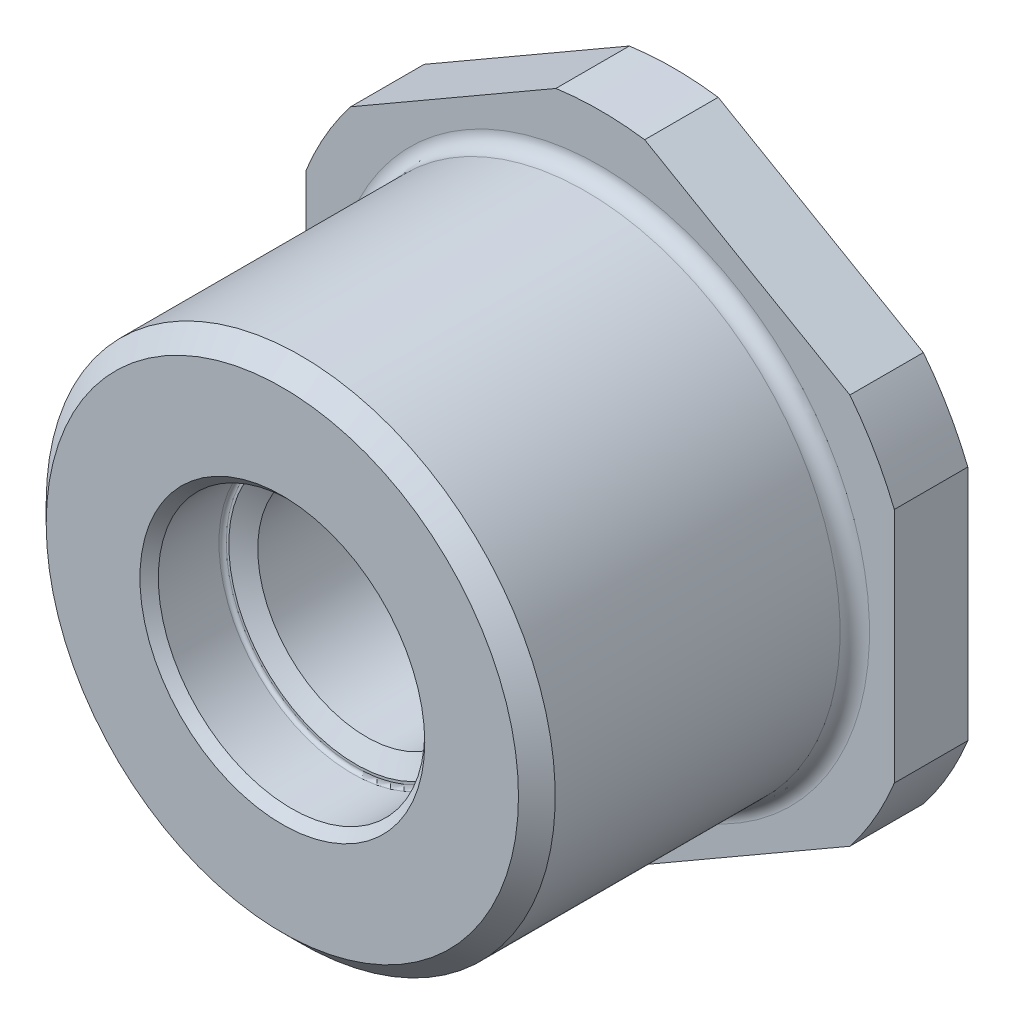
ISO-10303-21;
HEADER;
FILE_DESCRIPTION(('STEP AP214'),'2;1');
FILE_NAME('part.step','',(''),(''),'','','');
FILE_SCHEMA(('AUTOMOTIVE_DESIGN { 1 0 10303 214 1 1 1 1 }'));
ENDSEC;
DATA;
#1=APPLICATION_CONTEXT('core data for automotive mechanical design processes');
#2=APPLICATION_PROTOCOL_DEFINITION('international standard','automotive_design',2000,#1);
#3=PRODUCT_CONTEXT('',#1,'mechanical');
#4=PRODUCT('Part','Part','',(#3));
#5=PRODUCT_RELATED_PRODUCT_CATEGORY('part','',(#4));
#6=PRODUCT_DEFINITION_FORMATION('','',#4);
#7=PRODUCT_DEFINITION_CONTEXT('part definition',#1,'design');
#8=PRODUCT_DEFINITION('design','',#6,#7);
#9=PRODUCT_DEFINITION_SHAPE('','',#8);
#10=(LENGTH_UNIT() NAMED_UNIT(*) SI_UNIT(.MILLI.,.METRE.));
#11=(NAMED_UNIT(*) PLANE_ANGLE_UNIT() SI_UNIT($,.RADIAN.));
#12=(NAMED_UNIT(*) SI_UNIT($,.STERADIAN.) SOLID_ANGLE_UNIT());
#13=UNCERTAINTY_MEASURE_WITH_UNIT(LENGTH_MEASURE(1.E-05),#10,'distance_accuracy_value','');
#14=(GEOMETRIC_REPRESENTATION_CONTEXT(3) GLOBAL_UNCERTAINTY_ASSIGNED_CONTEXT((#13)) GLOBAL_UNIT_ASSIGNED_CONTEXT((#10,
#11,#12)) REPRESENTATION_CONTEXT('',''));
#15=CARTESIAN_POINT('',(0.,0.,0.));
#16=DIRECTION('',(0.,0.,1.));
#17=DIRECTION('',(1.,0.,0.));
#18=AXIS2_PLACEMENT_3D('',#15,#16,#17);
#19=CARTESIAN_POINT('',(-16.,-9.23760430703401,4.));
#20=DIRECTION('',(0.,0.,-0.999999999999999));
#21=DIRECTION('',(-1.,0.,0.));
#22=AXIS2_PLACEMENT_3D('',#19,#20,#21);
#23=PLANE('',#22);
#24=CARTESIAN_POINT('',(0.,0.,4.));
#25=DIRECTION('',(0.,0.,-0.999999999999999));
#26=DIRECTION('',(-1.,0.,0.));
#27=AXIS2_PLACEMENT_3D('',#24,#25,#26);
#28=CIRCLE('',#27,14.65);
#29=CARTESIAN_POINT('',(-14.65,0.,4.));
#30=VERTEX_POINT('',#29);
#31=EDGE_CURVE('E172',#30,#30,#28,.T.);
#32=ORIENTED_EDGE('',*,*,#31,.T.);
#33=EDGE_LOOP('',(#32));
#34=FACE_BOUND('',#33,.T.);
#35=CARTESIAN_POINT('',(0.,0.,4.));
#36=DIRECTION('',(0.,0.,-0.999999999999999));
#37=DIRECTION('',(-1.,0.,0.));
#38=AXIS2_PLACEMENT_3D('',#35,#36,#37);
#39=CIRCLE('',#38,17.25);
#40=CARTESIAN_POINT('',(-16.,6.44689847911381,4.));
#41=VERTEX_POINT('',#40);
#42=CARTESIAN_POINT('',(-13.5831778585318,10.6329572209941,4.));
#43=VERTEX_POINT('',#42);
#44=EDGE_CURVE('E138',#41,#43,#39,.T.);
#45=ORIENTED_EDGE('',*,*,#44,.F.);
#46=DIRECTION('',(0.,-1.,0.));
#47=VECTOR('',#46,1.);
#48=CARTESIAN_POINT('',(-16.,9.237604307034,4.));
#49=LINE('',#48,#47);
#50=CARTESIAN_POINT('',(-16.,-6.44689847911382,4.));
#51=VERTEX_POINT('',#50);
#52=EDGE_CURVE('E137',#41,#51,#49,.T.);
#53=ORIENTED_EDGE('',*,*,#52,.T.);
#54=CARTESIAN_POINT('',(-13.5831778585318,-10.6329572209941,4.));
#55=VERTEX_POINT('',#54);
#56=EDGE_CURVE('E263',#55,#51,#39,.T.);
#57=ORIENTED_EDGE('',*,*,#56,.F.);
#58=DIRECTION('',(0.866025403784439,-0.499999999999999,0.));
#59=VECTOR('',#58,1.);
#60=CARTESIAN_POINT('',(-16.,-9.23760430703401,4.));
#61=LINE('',#60,#59);
#62=CARTESIAN_POINT('',(-2.41682214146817,-17.0798557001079,4.));
#63=VERTEX_POINT('',#62);
#64=EDGE_CURVE('E144',#55,#63,#61,.T.);
#65=ORIENTED_EDGE('',*,*,#64,.T.);
#66=CARTESIAN_POINT('',(2.4168221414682,-17.0798557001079,4.));
#67=VERTEX_POINT('',#66);
#68=EDGE_CURVE('E250',#67,#63,#39,.T.);
#69=ORIENTED_EDGE('',*,*,#68,.F.);
#70=DIRECTION('',(0.866025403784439,0.500000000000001,0.));
#71=VECTOR('',#70,1.);
#72=CARTESIAN_POINT('',(0.,-18.475208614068,4.));
#73=LINE('',#72,#71);
#74=CARTESIAN_POINT('',(13.5831778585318,-10.6329572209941,4.));
#75=VERTEX_POINT('',#74);
#76=EDGE_CURVE('E148',#67,#75,#73,.T.);
#77=ORIENTED_EDGE('',*,*,#76,.T.);
#78=CARTESIAN_POINT('',(16.,-6.44689847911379,4.));
#79=VERTEX_POINT('',#78);
#80=EDGE_CURVE('E245',#79,#75,#39,.T.);
#81=ORIENTED_EDGE('',*,*,#80,.F.);
#82=DIRECTION('',(0.,1.,0.));
#83=VECTOR('',#82,1.);
#84=CARTESIAN_POINT('',(16.,-9.23760430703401,4.));
#85=LINE('',#84,#83);
#86=CARTESIAN_POINT('',(16.,6.44689847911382,4.));
#87=VERTEX_POINT('',#86);
#88=EDGE_CURVE('E156',#79,#87,#85,.T.);
#89=ORIENTED_EDGE('',*,*,#88,.T.);
#90=CARTESIAN_POINT('',(13.5831778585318,10.6329572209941,4.));
#91=VERTEX_POINT('',#90);
#92=EDGE_CURVE('E262',#91,#87,#39,.T.);
#93=ORIENTED_EDGE('',*,*,#92,.F.);
#94=DIRECTION('',(-0.866025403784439,0.5,0.));
#95=VECTOR('',#94,1.);
#96=CARTESIAN_POINT('',(16.,9.23760430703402,4.));
#97=LINE('',#96,#95);
#98=CARTESIAN_POINT('',(2.41682214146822,17.0798557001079,4.));
#99=VERTEX_POINT('',#98);
#100=EDGE_CURVE('E159',#91,#99,#97,.T.);
#101=ORIENTED_EDGE('',*,*,#100,.T.);
#102=CARTESIAN_POINT('',(-2.41682214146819,17.0798557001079,4.));
#103=VERTEX_POINT('',#102);
#104=EDGE_CURVE('E266',#103,#99,#39,.T.);
#105=ORIENTED_EDGE('',*,*,#104,.F.);
#106=DIRECTION('',(-0.866025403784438,-0.500000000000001,0.));
#107=VECTOR('',#106,1.);
#108=CARTESIAN_POINT('',(0.,18.475208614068,4.));
#109=LINE('',#108,#107);
#110=EDGE_CURVE('E162',#103,#43,#109,.T.);
#111=ORIENTED_EDGE('',*,*,#110,.T.);
#112=EDGE_LOOP('',(#45,#53,#57,#65,#69,#77,#81,#89,#93,#101,#105,#111));
#113=FACE_BOUND('',#112,.T.);
#114=ADVANCED_FACE('F30',(#34,#113),#23,.F.);
#115=CARTESIAN_POINT('',(-16.,-9.23760430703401,4.));
#116=DIRECTION('',(0.5,0.866025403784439,0.));
#117=DIRECTION('',(-0.866025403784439,0.499999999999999,0.));
#118=AXIS2_PLACEMENT_3D('',#115,#116,#117);
#119=PLANE('',#118);
#120=DIRECTION('',(0.,0.,-0.999999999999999));
#121=VECTOR('',#120,1.);
#122=CARTESIAN_POINT('',(-2.41682214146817,-17.0798557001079,21.3));
#123=LINE('',#122,#121);
#124=CARTESIAN_POINT('',(-2.41682214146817,-17.0798557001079,0.));
#125=VERTEX_POINT('',#124);
#126=EDGE_CURVE('E255',#63,#125,#123,.T.);
#127=ORIENTED_EDGE('',*,*,#126,.F.);
#128=ORIENTED_EDGE('',*,*,#64,.F.);
#129=DIRECTION('',(0.,0.,-0.999999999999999));
#130=VECTOR('',#129,1.);
#131=CARTESIAN_POINT('',(-13.5831778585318,-10.6329572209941,21.3));
#132=LINE('',#131,#130);
#133=CARTESIAN_POINT('',(-13.5831778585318,-10.6329572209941,0.));
#134=VERTEX_POINT('',#133);
#135=EDGE_CURVE('E265',#134,#55,#132,.F.);
#136=ORIENTED_EDGE('',*,*,#135,.F.);
#137=DIRECTION('',(0.866025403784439,-0.499999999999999,0.));
#138=VECTOR('',#137,1.);
#139=CARTESIAN_POINT('',(-16.,-9.23760430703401,0.));
#140=LINE('',#139,#138);
#141=EDGE_CURVE('E286',#134,#125,#140,.T.);
#142=ORIENTED_EDGE('',*,*,#141,.T.);
#143=EDGE_LOOP('',(#127,#128,#136,#142));
#144=FACE_BOUND('',#143,.T.);
#145=ADVANCED_FACE('F32',(#144),#119,.F.);
#146=CARTESIAN_POINT('',(0.,-18.475208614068,4.));
#147=DIRECTION('',(-0.5,0.866025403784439,0.));
#148=DIRECTION('',(-0.866025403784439,-0.500000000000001,0.));
#149=AXIS2_PLACEMENT_3D('',#146,#147,#148);
#150=PLANE('',#149);
#151=DIRECTION('',(0.,0.,-0.999999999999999));
#152=VECTOR('',#151,1.);
#153=CARTESIAN_POINT('',(13.5831778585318,-10.6329572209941,21.3));
#154=LINE('',#153,#152);
#155=CARTESIAN_POINT('',(13.5831778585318,-10.6329572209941,0.));
#156=VERTEX_POINT('',#155);
#157=EDGE_CURVE('E45',#75,#156,#154,.T.);
#158=ORIENTED_EDGE('',*,*,#157,.F.);
#159=ORIENTED_EDGE('',*,*,#76,.F.);
#160=DIRECTION('',(0.,0.,-0.999999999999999));
#161=VECTOR('',#160,1.);
#162=CARTESIAN_POINT('',(2.4168221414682,-17.0798557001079,21.3));
#163=LINE('',#162,#161);
#164=CARTESIAN_POINT('',(2.41682214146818,-17.0798557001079,0.));
#165=VERTEX_POINT('',#164);
#166=EDGE_CURVE('E244',#165,#67,#163,.F.);
#167=ORIENTED_EDGE('',*,*,#166,.F.);
#168=DIRECTION('',(0.866025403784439,0.500000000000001,0.));
#169=VECTOR('',#168,1.);
#170=CARTESIAN_POINT('',(0.,-18.475208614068,0.));
#171=LINE('',#170,#169);
#172=EDGE_CURVE('E243',#165,#156,#171,.T.);
#173=ORIENTED_EDGE('',*,*,#172,.T.);
#174=EDGE_LOOP('',(#158,#159,#167,#173));
#175=FACE_BOUND('',#174,.T.);
#176=ADVANCED_FACE('F216',(#175),#150,.F.);
#177=CARTESIAN_POINT('',(16.,-9.23760430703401,4.));
#178=DIRECTION('',(-1.,0.,0.));
#179=DIRECTION('',(0.,-1.,0.));
#180=AXIS2_PLACEMENT_3D('',#177,#178,#179);
#181=PLANE('',#180);
#182=DIRECTION('',(0.,0.,-0.999999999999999));
#183=VECTOR('',#182,1.);
#184=CARTESIAN_POINT('',(16.,6.44689847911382,21.3));
#185=LINE('',#184,#183);
#186=CARTESIAN_POINT('',(16.,6.44689847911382,0.));
#187=VERTEX_POINT('',#186);
#188=EDGE_CURVE('E53',#87,#187,#185,.T.);
#189=ORIENTED_EDGE('',*,*,#188,.F.);
#190=ORIENTED_EDGE('',*,*,#88,.F.);
#191=DIRECTION('',(0.,0.,-0.999999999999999));
#192=VECTOR('',#191,1.);
#193=CARTESIAN_POINT('',(16.,-6.44689847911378,21.3));
#194=LINE('',#193,#192);
#195=CARTESIAN_POINT('',(16.,-6.4468984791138,0.));
#196=VERTEX_POINT('',#195);
#197=EDGE_CURVE('E261',#196,#79,#194,.F.);
#198=ORIENTED_EDGE('',*,*,#197,.F.);
#199=DIRECTION('',(0.,1.,0.));
#200=VECTOR('',#199,1.);
#201=CARTESIAN_POINT('',(16.,-9.23760430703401,0.));
#202=LINE('',#201,#200);
#203=EDGE_CURVE('E290',#196,#187,#202,.T.);
#204=ORIENTED_EDGE('',*,*,#203,.T.);
#205=EDGE_LOOP('',(#189,#190,#198,#204));
#206=FACE_BOUND('',#205,.T.);
#207=ADVANCED_FACE('F231',(#206),#181,.F.);
#208=CARTESIAN_POINT('',(16.,9.23760430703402,4.));
#209=DIRECTION('',(-0.5,-0.866025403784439,0.));
#210=DIRECTION('',(0.866025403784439,-0.5,0.));
#211=AXIS2_PLACEMENT_3D('',#208,#209,#210);
#212=PLANE('',#211);
#213=DIRECTION('',(0.,0.,-0.999999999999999));
#214=VECTOR('',#213,1.);
#215=CARTESIAN_POINT('',(2.41682214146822,17.0798557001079,21.3));
#216=LINE('',#215,#214);
#217=CARTESIAN_POINT('',(2.41682214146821,17.0798557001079,0.));
#218=VERTEX_POINT('',#217);
#219=EDGE_CURVE('E271',#99,#218,#216,.T.);
#220=ORIENTED_EDGE('',*,*,#219,.F.);
#221=ORIENTED_EDGE('',*,*,#100,.F.);
#222=DIRECTION('',(0.,0.,-0.999999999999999));
#223=VECTOR('',#222,1.);
#224=CARTESIAN_POINT('',(13.5831778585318,10.6329572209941,21.3));
#225=LINE('',#224,#223);
#226=CARTESIAN_POINT('',(13.5831778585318,10.6329572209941,0.));
#227=VERTEX_POINT('',#226);
#228=EDGE_CURVE('E275',#227,#91,#225,.F.);
#229=ORIENTED_EDGE('',*,*,#228,.F.);
#230=DIRECTION('',(-0.866025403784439,0.5,0.));
#231=VECTOR('',#230,1.);
#232=CARTESIAN_POINT('',(16.,9.23760430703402,0.));
#233=LINE('',#232,#231);
#234=EDGE_CURVE('E150',#227,#218,#233,.T.);
#235=ORIENTED_EDGE('',*,*,#234,.T.);
#236=EDGE_LOOP('',(#220,#221,#229,#235));
#237=FACE_BOUND('',#236,.T.);
#238=ADVANCED_FACE('F227',(#237),#212,.F.);
#239=CARTESIAN_POINT('',(0.,18.475208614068,4.));
#240=DIRECTION('',(0.500000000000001,-0.866025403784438,0.));
#241=DIRECTION('',(0.866025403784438,0.500000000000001,0.));
#242=AXIS2_PLACEMENT_3D('',#239,#240,#241);
#243=PLANE('',#242);
#244=DIRECTION('',(0.,0.,-0.999999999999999));
#245=VECTOR('',#244,1.);
#246=CARTESIAN_POINT('',(-13.5831778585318,10.6329572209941,21.3));
#247=LINE('',#246,#245);
#248=CARTESIAN_POINT('',(-13.5831778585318,10.6329572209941,0.));
#249=VERTEX_POINT('',#248);
#250=EDGE_CURVE('E124',#43,#249,#247,.T.);
#251=ORIENTED_EDGE('',*,*,#250,.F.);
#252=ORIENTED_EDGE('',*,*,#110,.F.);
#253=DIRECTION('',(0.,0.,-0.999999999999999));
#254=VECTOR('',#253,1.);
#255=CARTESIAN_POINT('',(-2.41682214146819,17.0798557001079,21.3));
#256=LINE('',#255,#254);
#257=CARTESIAN_POINT('',(-2.4168221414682,17.0798557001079,0.));
#258=VERTEX_POINT('',#257);
#259=EDGE_CURVE('E268',#258,#103,#256,.F.);
#260=ORIENTED_EDGE('',*,*,#259,.F.);
#261=DIRECTION('',(-0.866025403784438,-0.500000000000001,0.));
#262=VECTOR('',#261,1.);
#263=CARTESIAN_POINT('',(0.,18.475208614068,0.));
#264=LINE('',#263,#262);
#265=EDGE_CURVE('E145',#258,#249,#264,.T.);
#266=ORIENTED_EDGE('',*,*,#265,.T.);
#267=EDGE_LOOP('',(#251,#252,#260,#266));
#268=FACE_BOUND('',#267,.T.);
#269=ADVANCED_FACE('F224',(#268),#243,.F.);
#270=CARTESIAN_POINT('',(-16.,9.237604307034,4.));
#271=DIRECTION('',(1.,0.,0.));
#272=DIRECTION('',(0.,0.,-0.999999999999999));
#273=AXIS2_PLACEMENT_3D('',#270,#271,#272);
#274=PLANE('',#273);
#275=DIRECTION('',(0.,0.,-0.999999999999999));
#276=VECTOR('',#275,1.);
#277=CARTESIAN_POINT('',(-16.,-6.44689847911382,21.3));
#278=LINE('',#277,#276);
#279=CARTESIAN_POINT('',(-16.,-6.44689847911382,0.));
#280=VERTEX_POINT('',#279);
#281=EDGE_CURVE('E264',#51,#280,#278,.T.);
#282=ORIENTED_EDGE('',*,*,#281,.F.);
#283=ORIENTED_EDGE('',*,*,#52,.F.);
#284=DIRECTION('',(0.,0.,-0.999999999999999));
#285=VECTOR('',#284,1.);
#286=CARTESIAN_POINT('',(-16.,6.44689847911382,21.3));
#287=LINE('',#286,#285);
#288=CARTESIAN_POINT('',(-16.,6.44689847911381,0.));
#289=VERTEX_POINT('',#288);
#290=EDGE_CURVE('E121',#289,#41,#287,.F.);
#291=ORIENTED_EDGE('',*,*,#290,.F.);
#292=DIRECTION('',(0.,-1.,0.));
#293=VECTOR('',#292,1.);
#294=CARTESIAN_POINT('',(-16.,9.23760430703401,0.));
#295=LINE('',#294,#293);
#296=EDGE_CURVE('E135',#289,#280,#295,.T.);
#297=ORIENTED_EDGE('',*,*,#296,.T.);
#298=EDGE_LOOP('',(#282,#283,#291,#297));
#299=FACE_BOUND('',#298,.T.);
#300=ADVANCED_FACE('F134',(#299),#274,.F.);
#301=CARTESIAN_POINT('',(-16.,-9.23760430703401,0.));
#302=DIRECTION('',(0.,0.,-0.999999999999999));
#303=DIRECTION('',(-1.,0.,0.));
#304=AXIS2_PLACEMENT_3D('',#301,#302,#303);
#305=PLANE('',#304);
#306=CARTESIAN_POINT('',(0.,0.,0.));
#307=DIRECTION('',(0.,0.,0.999999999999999));
#308=DIRECTION('',(1.,0.,0.));
#309=AXIS2_PLACEMENT_3D('',#306,#307,#308);
#310=CIRCLE('',#309,5.915);
#311=CARTESIAN_POINT('',(5.915,0.,0.));
#312=VERTEX_POINT('',#311);
#313=EDGE_CURVE('E257',#312,#312,#310,.T.);
#314=ORIENTED_EDGE('',*,*,#313,.T.);
#315=EDGE_LOOP('',(#314));
#316=FACE_BOUND('',#315,.T.);
#317=ORIENTED_EDGE('',*,*,#296,.F.);
#318=CARTESIAN_POINT('',(0.,0.,0.));
#319=DIRECTION('',(0.,0.,-0.999999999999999));
#320=DIRECTION('',(-1.,0.,0.));
#321=AXIS2_PLACEMENT_3D('',#318,#319,#320);
#322=CIRCLE('',#321,17.25);
#323=EDGE_CURVE('E118',#289,#249,#322,.T.);
#324=ORIENTED_EDGE('',*,*,#323,.T.);
#325=ORIENTED_EDGE('',*,*,#265,.F.);
#326=CARTESIAN_POINT('',(0.,0.,0.));
#327=DIRECTION('',(0.,0.,-0.999999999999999));
#328=DIRECTION('',(-1.,0.,0.));
#329=AXIS2_PLACEMENT_3D('',#326,#327,#328);
#330=CIRCLE('',#329,17.25);
#331=EDGE_CURVE('E168',#258,#218,#330,.T.);
#332=ORIENTED_EDGE('',*,*,#331,.T.);
#333=ORIENTED_EDGE('',*,*,#234,.F.);
#334=EDGE_CURVE('E297',#227,#187,#330,.T.);
#335=ORIENTED_EDGE('',*,*,#334,.T.);
#336=ORIENTED_EDGE('',*,*,#203,.F.);
#337=EDGE_CURVE('E299',#196,#156,#330,.T.);
#338=ORIENTED_EDGE('',*,*,#337,.T.);
#339=ORIENTED_EDGE('',*,*,#172,.F.);
#340=EDGE_CURVE('E167',#165,#125,#330,.T.);
#341=ORIENTED_EDGE('',*,*,#340,.T.);
#342=ORIENTED_EDGE('',*,*,#141,.F.);
#343=EDGE_CURVE('E143',#134,#280,#330,.T.);
#344=ORIENTED_EDGE('',*,*,#343,.T.);
#345=EDGE_LOOP('',(#317,#324,#325,#332,#333,#335,#336,#338,#339,#341,#342,#344));
#346=FACE_BOUND('',#345,.T.);
#347=ADVANCED_FACE('F141',(#316,#346),#305,.T.);
#348=CARTESIAN_POINT('',(0.,0.,21.3));
#349=DIRECTION('',(0.,0.,-0.999999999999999));
#350=DIRECTION('',(-1.,0.,0.));
#351=AXIS2_PLACEMENT_3D('',#348,#349,#350);
#352=CYLINDRICAL_SURFACE('',#351,13.85);
#353=CARTESIAN_POINT('',(0.,0.,20.3));
#354=DIRECTION('',(0.,0.,0.999999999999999));
#355=DIRECTION('',(1.,0.,0.));
#356=AXIS2_PLACEMENT_3D('',#353,#354,#355);
#357=CIRCLE('',#356,13.85);
#358=CARTESIAN_POINT('',(-13.85,0.,20.3));
#359=VERTEX_POINT('',#358);
#360=EDGE_CURVE('E178',#359,#359,#357,.F.);
#361=CARTESIAN_POINT('',(0.,0.,4.8));
#362=DIRECTION('',(0.,0.,-0.999999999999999));
#363=DIRECTION('',(-1.,0.,0.));
#364=AXIS2_PLACEMENT_3D('',#361,#362,#363);
#365=CIRCLE('',#364,13.85);
#366=CARTESIAN_POINT('',(-13.85,0.,4.8));
#367=VERTEX_POINT('',#366);
#368=EDGE_CURVE('E169',#367,#367,#365,.F.);
#369=CARTESIAN_POINT('',(-13.85,0.,20.3));
#370=CARTESIAN_POINT('',(-13.85,0.,20.1385416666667));
#371=CARTESIAN_POINT('',(-13.85,0.,19.9770833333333));
#372=CARTESIAN_POINT('',(-13.85,0.,19.6541666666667));
#373=CARTESIAN_POINT('',(-13.85,0.,19.4927083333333));
#374=CARTESIAN_POINT('',(-13.85,0.,19.1697916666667));
#375=CARTESIAN_POINT('',(-13.85,0.,19.0083333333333));
#376=CARTESIAN_POINT('',(-13.85,0.,18.6854166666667));
#377=CARTESIAN_POINT('',(-13.85,0.,18.5239583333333));
#378=CARTESIAN_POINT('',(-13.85,0.,18.2010416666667));
#379=CARTESIAN_POINT('',(-13.85,0.,18.0395833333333));
#380=CARTESIAN_POINT('',(-13.85,0.,17.7166666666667));
#381=CARTESIAN_POINT('',(-13.85,0.,17.5552083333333));
#382=CARTESIAN_POINT('',(-13.85,0.,17.2322916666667));
#383=CARTESIAN_POINT('',(-13.85,0.,17.0708333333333));
#384=CARTESIAN_POINT('',(-13.85,0.,16.7479166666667));
#385=CARTESIAN_POINT('',(-13.85,0.,16.5864583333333));
#386=CARTESIAN_POINT('',(-13.85,0.,16.2635416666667));
#387=CARTESIAN_POINT('',(-13.85,0.,16.1020833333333));
#388=CARTESIAN_POINT('',(-13.85,0.,15.7791666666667));
#389=CARTESIAN_POINT('',(-13.85,0.,15.6177083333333));
#390=CARTESIAN_POINT('',(-13.85,0.,15.2947916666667));
#391=CARTESIAN_POINT('',(-13.85,0.,15.1333333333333));
#392=CARTESIAN_POINT('',(-13.85,0.,14.8104166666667));
#393=CARTESIAN_POINT('',(-13.85,0.,14.6489583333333));
#394=CARTESIAN_POINT('',(-13.85,0.,14.3260416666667));
#395=CARTESIAN_POINT('',(-13.85,0.,14.1645833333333));
#396=CARTESIAN_POINT('',(-13.85,0.,13.8416666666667));
#397=CARTESIAN_POINT('',(-13.85,0.,13.6802083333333));
#398=CARTESIAN_POINT('',(-13.85,0.,13.3572916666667));
#399=CARTESIAN_POINT('',(-13.85,0.,13.1958333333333));
#400=CARTESIAN_POINT('',(-13.85,0.,12.8729166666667));
#401=CARTESIAN_POINT('',(-13.85,0.,12.7114583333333));
#402=CARTESIAN_POINT('',(-13.85,0.,12.3885416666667));
#403=CARTESIAN_POINT('',(-13.85,0.,12.2270833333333));
#404=CARTESIAN_POINT('',(-13.85,0.,11.9041666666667));
#405=CARTESIAN_POINT('',(-13.85,0.,11.7427083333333));
#406=CARTESIAN_POINT('',(-13.85,0.,11.4197916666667));
#407=CARTESIAN_POINT('',(-13.85,0.,11.2583333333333));
#408=CARTESIAN_POINT('',(-13.85,0.,10.9354166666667));
#409=CARTESIAN_POINT('',(-13.85,0.,10.7739583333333));
#410=CARTESIAN_POINT('',(-13.85,0.,10.4510416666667));
#411=CARTESIAN_POINT('',(-13.85,0.,10.2895833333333));
#412=CARTESIAN_POINT('',(-13.85,0.,9.96666666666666));
#413=CARTESIAN_POINT('',(-13.85,0.,9.80520833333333));
#414=CARTESIAN_POINT('',(-13.85,0.,9.48229166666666));
#415=CARTESIAN_POINT('',(-13.85,0.,9.32083333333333));
#416=CARTESIAN_POINT('',(-13.85,0.,8.99791666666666));
#417=CARTESIAN_POINT('',(-13.85,0.,8.83645833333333));
#418=CARTESIAN_POINT('',(-13.85,0.,8.51354166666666));
#419=CARTESIAN_POINT('',(-13.85,0.,8.35208333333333));
#420=CARTESIAN_POINT('',(-13.85,0.,8.02916666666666));
#421=CARTESIAN_POINT('',(-13.85,0.,7.86770833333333));
#422=CARTESIAN_POINT('',(-13.85,0.,7.54479166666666));
#423=CARTESIAN_POINT('',(-13.85,0.,7.38333333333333));
#424=CARTESIAN_POINT('',(-13.85,0.,7.06041666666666));
#425=CARTESIAN_POINT('',(-13.85,0.,6.89895833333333));
#426=CARTESIAN_POINT('',(-13.85,0.,6.57604166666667));
#427=CARTESIAN_POINT('',(-13.85,0.,6.41458333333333));
#428=CARTESIAN_POINT('',(-13.85,0.,6.09166666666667));
#429=CARTESIAN_POINT('',(-13.85,0.,5.93020833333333));
#430=CARTESIAN_POINT('',(-13.85,0.,5.60729166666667));
#431=CARTESIAN_POINT('',(-13.85,0.,5.44583333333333));
#432=CARTESIAN_POINT('',(-13.85,0.,5.12291666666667));
#433=CARTESIAN_POINT('',(-13.85,0.,4.96145833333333));
#434=CARTESIAN_POINT('',(-13.85,0.,4.8));
#435=B_SPLINE_CURVE_WITH_KNOTS('',3,(#369,#370,#371,#372,#373,#374,#375,#376,#377,#378,#379,
#380,#381,#382,#383,#384,#385,#386,#387,#388,#389,#390,#391,#392,#393,#394,#395,#396,#397,#398,
#399,#400,#401,#402,#403,#404,#405,#406,#407,#408,#409,#410,#411,#412,#413,#414,#415,#416,#417,
#418,#419,#420,#421,#422,#423,#424,#425,#426,#427,#428,#429,#430,#431,#432,#433,#434),
.UNSPECIFIED.,.F.,.F.,(4,2,2,2,2,2,2,2,2,2,2,2,2,2,2,2,2,2,2,2,2,2,2,2,2,2,2,2,2,2,2,2,4),(0.,
0.484374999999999,0.968749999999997,1.453125,1.93749999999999,2.421875,2.90625,3.39062499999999,
3.875,4.359375,4.84374999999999,5.32812499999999,5.81249999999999,6.29687499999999,
6.78124999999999,7.26562499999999,7.74999999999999,8.23437499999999,8.71874999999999,
9.20312499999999,9.68749999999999,10.171875,10.65625,11.140625,11.625,12.109375,12.59375,
13.078125,13.5625,14.046875,14.53125,15.015625,15.5),.UNSPECIFIED.);
#436=EDGE_CURVE('BSEAM336',#359,#367,#435,.T.);
#437=ORIENTED_EDGE('',*,*,#360,.T.);
#438=ORIENTED_EDGE('',*,*,#368,.T.);
#439=ORIENTED_EDGE('',*,*,#436,.T.);
#440=ORIENTED_EDGE('',*,*,#436,.F.);
#441=EDGE_LOOP('',(#437,#439,#438,#440));
#442=FACE_BOUND('',#441,.T.);
#443=ADVANCED_FACE('F336',(#442),#352,.T.);
#444=CARTESIAN_POINT('',(0.,0.,21.3));
#445=DIRECTION('',(0.,0.,0.999999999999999));
#446=DIRECTION('',(1.,0.,0.));
#447=AXIS2_PLACEMENT_3D('',#444,#445,#446);
#448=PLANE('',#447);
#449=CARTESIAN_POINT('',(0.,0.,21.3));
#450=DIRECTION('',(0.,0.,0.999999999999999));
#451=DIRECTION('',(1.,0.,0.));
#452=AXIS2_PLACEMENT_3D('',#449,#450,#451);
#453=CIRCLE('',#452,7.75);
#454=CARTESIAN_POINT('',(7.75000000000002,0.,21.3));
#455=VERTEX_POINT('',#454);
#456=EDGE_CURVE('E190',#455,#455,#453,.F.);
#457=ORIENTED_EDGE('',*,*,#456,.T.);
#458=EDGE_LOOP('',(#457));
#459=FACE_BOUND('',#458,.T.);
#460=CARTESIAN_POINT('',(0.,0.,21.3));
#461=DIRECTION('',(0.,0.,0.999999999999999));
#462=DIRECTION('',(1.,0.,0.));
#463=AXIS2_PLACEMENT_3D('',#460,#461,#462);
#464=CIRCLE('',#463,12.85);
#465=CARTESIAN_POINT('',(-12.85,0.,21.3));
#466=VERTEX_POINT('',#465);
#467=EDGE_CURVE('E175',#466,#466,#464,.T.);
#468=ORIENTED_EDGE('',*,*,#467,.T.);
#469=EDGE_LOOP('',(#468));
#470=FACE_BOUND('',#469,.T.);
#471=ADVANCED_FACE('F333',(#459,#470),#448,.T.);
#472=CARTESIAN_POINT('',(0.,0.,17.3));
#473=DIRECTION('',(0.,0.,0.999999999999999));
#474=DIRECTION('',(1.,0.,0.));
#475=AXIS2_PLACEMENT_3D('',#472,#473,#474);
#476=CYLINDRICAL_SURFACE('',#475,7.25);
#477=CARTESIAN_POINT('',(0.,0.,17.5));
#478=DIRECTION('',(0.,0.,0.999999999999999));
#479=DIRECTION('',(1.,0.,0.));
#480=AXIS2_PLACEMENT_3D('',#477,#478,#479);
#481=CIRCLE('',#480,7.25);
#482=CARTESIAN_POINT('',(7.25,0.,17.5));
#483=VERTEX_POINT('',#482);
#484=EDGE_CURVE('E11',#483,#483,#481,.F.);
#485=CARTESIAN_POINT('',(0.,0.,20.8));
#486=DIRECTION('',(0.,0.,0.999999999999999));
#487=DIRECTION('',(1.,0.,0.));
#488=AXIS2_PLACEMENT_3D('',#485,#486,#487);
#489=CIRCLE('',#488,7.25);
#490=CARTESIAN_POINT('',(7.25,0.,20.8));
#491=VERTEX_POINT('',#490);
#492=EDGE_CURVE('E187',#491,#491,#489,.T.);
#493=CARTESIAN_POINT('',(7.25,0.,17.5));
#494=CARTESIAN_POINT('',(7.25,0.,17.534375));
#495=CARTESIAN_POINT('',(7.25,0.,17.56875));
#496=CARTESIAN_POINT('',(7.25,0.,17.6375));
#497=CARTESIAN_POINT('',(7.25,0.,17.671875));
#498=CARTESIAN_POINT('',(7.25,0.,17.740625));
#499=CARTESIAN_POINT('',(7.25,0.,17.775));
#500=CARTESIAN_POINT('',(7.25,0.,17.84375));
#501=CARTESIAN_POINT('',(7.25,0.,17.878125));
#502=CARTESIAN_POINT('',(7.25,0.,17.946875));
#503=CARTESIAN_POINT('',(7.25,0.,17.98125));
#504=CARTESIAN_POINT('',(7.25,0.,18.05));
#505=CARTESIAN_POINT('',(7.25,0.,18.084375));
#506=CARTESIAN_POINT('',(7.25,0.,18.153125));
#507=CARTESIAN_POINT('',(7.25,0.,18.1875));
#508=CARTESIAN_POINT('',(7.25,0.,18.25625));
#509=CARTESIAN_POINT('',(7.25,0.,18.290625));
#510=CARTESIAN_POINT('',(7.25,0.,18.359375));
#511=CARTESIAN_POINT('',(7.25,0.,18.39375));
#512=CARTESIAN_POINT('',(7.25,0.,18.4625));
#513=CARTESIAN_POINT('',(7.25,0.,18.496875));
#514=CARTESIAN_POINT('',(7.25,0.,18.565625));
#515=CARTESIAN_POINT('',(7.25,0.,18.6));
#516=CARTESIAN_POINT('',(7.25,0.,18.66875));
#517=CARTESIAN_POINT('',(7.25,0.,18.703125));
#518=CARTESIAN_POINT('',(7.25,0.,18.771875));
#519=CARTESIAN_POINT('',(7.25,0.,18.80625));
#520=CARTESIAN_POINT('',(7.25,0.,18.875));
#521=CARTESIAN_POINT('',(7.25,0.,18.909375));
#522=CARTESIAN_POINT('',(7.25,0.,18.978125));
#523=CARTESIAN_POINT('',(7.25,0.,19.0125));
#524=CARTESIAN_POINT('',(7.25,0.,19.08125));
#525=CARTESIAN_POINT('',(7.25,0.,19.115625));
#526=CARTESIAN_POINT('',(7.25,0.,19.184375));
#527=CARTESIAN_POINT('',(7.25,0.,19.21875));
#528=CARTESIAN_POINT('',(7.25,0.,19.2875));
#529=CARTESIAN_POINT('',(7.25,0.,19.321875));
#530=CARTESIAN_POINT('',(7.25,0.,19.390625));
#531=CARTESIAN_POINT('',(7.25,0.,19.425));
#532=CARTESIAN_POINT('',(7.25,0.,19.49375));
#533=CARTESIAN_POINT('',(7.25,0.,19.528125));
#534=CARTESIAN_POINT('',(7.25,0.,19.596875));
#535=CARTESIAN_POINT('',(7.25,0.,19.63125));
#536=CARTESIAN_POINT('',(7.25,0.,19.7));
#537=CARTESIAN_POINT('',(7.25,0.,19.734375));
#538=CARTESIAN_POINT('',(7.25,0.,19.803125));
#539=CARTESIAN_POINT('',(7.25,0.,19.8375));
#540=CARTESIAN_POINT('',(7.25,0.,19.90625));
#541=CARTESIAN_POINT('',(7.25,0.,19.940625));
#542=CARTESIAN_POINT('',(7.25,0.,20.009375));
#543=CARTESIAN_POINT('',(7.25,0.,20.04375));
#544=CARTESIAN_POINT('',(7.25,0.,20.1125));
#545=CARTESIAN_POINT('',(7.25,0.,20.146875));
#546=CARTESIAN_POINT('',(7.25,0.,20.215625));
#547=CARTESIAN_POINT('',(7.25,0.,20.25));
#548=CARTESIAN_POINT('',(7.25,0.,20.31875));
#549=CARTESIAN_POINT('',(7.25,0.,20.353125));
#550=CARTESIAN_POINT('',(7.25,0.,20.421875));
#551=CARTESIAN_POINT('',(7.25,0.,20.45625));
#552=CARTESIAN_POINT('',(7.25,0.,20.525));
#553=CARTESIAN_POINT('',(7.25,0.,20.559375));
#554=CARTESIAN_POINT('',(7.25,0.,20.628125));
#555=CARTESIAN_POINT('',(7.25,0.,20.6625));
#556=CARTESIAN_POINT('',(7.25,0.,20.73125));
#557=CARTESIAN_POINT('',(7.25,0.,20.765625));
#558=CARTESIAN_POINT('',(7.25,0.,20.8));
#559=B_SPLINE_CURVE_WITH_KNOTS('',3,(#493,#494,#495,#496,#497,#498,#499,#500,#501,#502,#503,
#504,#505,#506,#507,#508,#509,#510,#511,#512,#513,#514,#515,#516,#517,#518,#519,#520,#521,#522,
#523,#524,#525,#526,#527,#528,#529,#530,#531,#532,#533,#534,#535,#536,#537,#538,#539,#540,#541,
#542,#543,#544,#545,#546,#547,#548,#549,#550,#551,#552,#553,#554,#555,#556,#557,#558),
.UNSPECIFIED.,.F.,.F.,(4,2,2,2,2,2,2,2,2,2,2,2,2,2,2,2,2,2,2,2,2,2,2,2,2,2,2,2,2,2,2,2,4),(0.,
0.103125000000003,0.206250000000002,0.309375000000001,0.4125,0.515625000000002,
0.618750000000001,0.721875,0.825000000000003,0.928125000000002,1.03125,1.134375,1.2375,1.340625,
1.44375,1.546875,1.65,1.753125,1.85625,1.959375,2.0625,2.165625,2.26875,2.371875,2.475,2.578125,
2.68125,2.784375,2.8875,2.990625,3.09375,3.196875,3.3),.UNSPECIFIED.);
#560=EDGE_CURVE('BSEAM327',#483,#491,#559,.T.);
#561=ORIENTED_EDGE('',*,*,#484,.T.);
#562=ORIENTED_EDGE('',*,*,#492,.T.);
#563=ORIENTED_EDGE('',*,*,#560,.T.);
#564=ORIENTED_EDGE('',*,*,#560,.F.);
#565=EDGE_LOOP('',(#561,#563,#562,#564));
#566=FACE_BOUND('',#565,.T.);
#567=ADVANCED_FACE('F327',(#566),#476,.F.);
#568=CARTESIAN_POINT('',(0.,0.,17.3));
#569=DIRECTION('',(0.,0.,0.999999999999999));
#570=DIRECTION('',(1.,0.,0.));
#571=AXIS2_PLACEMENT_3D('',#568,#569,#570);
#572=PLANE('',#571);
#573=CARTESIAN_POINT('',(0.,0.,17.3));
#574=DIRECTION('',(0.,0.,0.999999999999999));
#575=DIRECTION('',(1.,0.,0.));
#576=AXIS2_PLACEMENT_3D('',#573,#574,#575);
#577=CIRCLE('',#576,7.05);
#578=CARTESIAN_POINT('',(7.05,0.,17.3));
#579=VERTEX_POINT('',#578);
#580=EDGE_CURVE('E38',#579,#579,#577,.T.);
#581=ORIENTED_EDGE('',*,*,#580,.T.);
#582=EDGE_LOOP('',(#581));
#583=FACE_BOUND('',#582,.T.);
#584=CARTESIAN_POINT('',(0.,0.,17.3));
#585=DIRECTION('',(0.,0.,0.999999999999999));
#586=DIRECTION('',(1.,0.,0.));
#587=AXIS2_PLACEMENT_3D('',#584,#585,#586);
#588=CIRCLE('',#587,6.91500000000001);
#589=CARTESIAN_POINT('',(6.91499999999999,0.,17.3));
#590=VERTEX_POINT('',#589);
#591=EDGE_CURVE('E184',#590,#590,#588,.F.);
#592=ORIENTED_EDGE('',*,*,#591,.T.);
#593=EDGE_LOOP('',(#592));
#594=FACE_BOUND('',#593,.T.);
#595=ADVANCED_FACE('F195',(#583,#594),#572,.T.);
#596=CARTESIAN_POINT('',(0.,0.,0.));
#597=DIRECTION('',(0.,0.,0.999999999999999));
#598=DIRECTION('',(1.,0.,0.));
#599=AXIS2_PLACEMENT_3D('',#596,#597,#598);
#600=CYLINDRICAL_SURFACE('',#599,5.915);
#601=CARTESIAN_POINT('',(0.,0.,16.7226497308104));
#602=DIRECTION('',(0.,0.,0.999999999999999));
#603=DIRECTION('',(1.,0.,0.));
#604=AXIS2_PLACEMENT_3D('',#601,#602,#603);
#605=CIRCLE('',#604,5.915);
#606=CARTESIAN_POINT('',(5.915,0.,16.7226497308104));
#607=VERTEX_POINT('',#606);
#608=EDGE_CURVE('E181',#607,#607,#605,.T.);
#609=CARTESIAN_POINT('',(5.915,0.,16.7226497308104));
#610=CARTESIAN_POINT('',(5.915,0.,16.5484554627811));
#611=CARTESIAN_POINT('',(5.915,0.,16.3742611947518));
#612=CARTESIAN_POINT('',(5.915,0.,16.0258726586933));
#613=CARTESIAN_POINT('',(5.915,0.,15.851678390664));
#614=CARTESIAN_POINT('',(5.915,0.,15.5032898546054));
#615=CARTESIAN_POINT('',(5.915,0.,15.3290955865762));
#616=CARTESIAN_POINT('',(5.915,0.,14.9807070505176));
#617=CARTESIAN_POINT('',(5.915,0.,14.8065127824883));
#618=CARTESIAN_POINT('',(5.915,0.,14.4581242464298));
#619=CARTESIAN_POINT('',(5.915,0.,14.2839299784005));
#620=CARTESIAN_POINT('',(5.915,0.,13.935541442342));
#621=CARTESIAN_POINT('',(5.915,0.,13.7613471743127));
#622=CARTESIAN_POINT('',(5.915,0.,13.4129586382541));
#623=CARTESIAN_POINT('',(5.915,0.,13.2387643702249));
#624=CARTESIAN_POINT('',(5.915,0.,12.8903758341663));
#625=CARTESIAN_POINT('',(5.915,0.,12.716181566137));
#626=CARTESIAN_POINT('',(5.915,0.,12.3677930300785));
#627=CARTESIAN_POINT('',(5.915,0.,12.1935987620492));
#628=CARTESIAN_POINT('',(5.915,0.,11.8452102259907));
#629=CARTESIAN_POINT('',(5.915,0.,11.6710159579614));
#630=CARTESIAN_POINT('',(5.915,0.,11.3226274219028));
#631=CARTESIAN_POINT('',(5.915,0.,11.1484331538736));
#632=CARTESIAN_POINT('',(5.915,0.,10.800044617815));
#633=CARTESIAN_POINT('',(5.915,0.,10.6258503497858));
#634=CARTESIAN_POINT('',(5.915,0.,10.2774618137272));
#635=CARTESIAN_POINT('',(5.915,0.,10.1032675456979));
#636=CARTESIAN_POINT('',(5.915,0.,9.75487900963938));
#637=CARTESIAN_POINT('',(5.915,0.,9.5806847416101));
#638=CARTESIAN_POINT('',(5.915,0.,9.23229620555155));
#639=CARTESIAN_POINT('',(5.915,0.,9.05810193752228));
#640=CARTESIAN_POINT('',(5.915,0.,8.70971340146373));
#641=CARTESIAN_POINT('',(5.915,0.,8.53551913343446));
#642=CARTESIAN_POINT('',(5.915,0.,8.18713059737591));
#643=CARTESIAN_POINT('',(5.915,0.,8.01293632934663));
#644=CARTESIAN_POINT('',(5.915,0.,7.66454779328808));
#645=CARTESIAN_POINT('',(5.915,0.,7.49035352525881));
#646=CARTESIAN_POINT('',(5.915,0.,7.14196498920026));
#647=CARTESIAN_POINT('',(5.915,0.,6.96777072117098));
#648=CARTESIAN_POINT('',(5.915,0.,6.61938218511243));
#649=CARTESIAN_POINT('',(5.915,0.,6.44518791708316));
#650=CARTESIAN_POINT('',(5.915,0.,6.09679938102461));
#651=CARTESIAN_POINT('',(5.915,0.,5.92260511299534));
#652=CARTESIAN_POINT('',(5.915,0.,5.57421657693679));
#653=CARTESIAN_POINT('',(5.915,0.,5.40002230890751));
#654=CARTESIAN_POINT('',(5.915,0.,5.05163377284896));
#655=CARTESIAN_POINT('',(5.915,0.,4.87743950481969));
#656=CARTESIAN_POINT('',(5.915,0.,4.52905096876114));
#657=CARTESIAN_POINT('',(5.915,0.,4.35485670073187));
#658=CARTESIAN_POINT('',(5.915,0.,4.00646816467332));
#659=CARTESIAN_POINT('',(5.915,0.,3.83227389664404));
#660=CARTESIAN_POINT('',(5.915,0.,3.48388536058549));
#661=CARTESIAN_POINT('',(5.915,0.,3.30969109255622));
#662=CARTESIAN_POINT('',(5.915,0.,2.96130255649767));
#663=CARTESIAN_POINT('',(5.915,0.,2.78710828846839));
#664=CARTESIAN_POINT('',(5.915,0.,2.43871975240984));
#665=CARTESIAN_POINT('',(5.915,0.,2.26452548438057));
#666=CARTESIAN_POINT('',(5.915,0.,1.91613694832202));
#667=CARTESIAN_POINT('',(5.915,0.,1.74194268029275));
#668=CARTESIAN_POINT('',(5.915,0.,1.3935541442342));
#669=CARTESIAN_POINT('',(5.915,0.,1.21935987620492));
#670=CARTESIAN_POINT('',(5.915,0.,0.870971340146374));
#671=CARTESIAN_POINT('',(5.915,0.,0.696777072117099));
#672=CARTESIAN_POINT('',(5.915,0.,0.348388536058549));
#673=CARTESIAN_POINT('',(5.915,0.,0.174194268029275));
#674=CARTESIAN_POINT('',(5.915,0.,0.));
#675=B_SPLINE_CURVE_WITH_KNOTS('',3,(#609,#610,#611,#612,#613,#614,#615,#616,#617,#618,#619,
#620,#621,#622,#623,#624,#625,#626,#627,#628,#629,#630,#631,#632,#633,#634,#635,#636,#637,#638,
#639,#640,#641,#642,#643,#644,#645,#646,#647,#648,#649,#650,#651,#652,#653,#654,#655,#656,#657,
#658,#659,#660,#661,#662,#663,#664,#665,#666,#667,#668,#669,#670,#671,#672,#673,#674),
.UNSPECIFIED.,.F.,.F.,(4,2,2,2,2,2,2,2,2,2,2,2,2,2,2,2,2,2,2,2,2,2,2,2,2,2,2,2,2,2,2,2,4),(0.,
0.522582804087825,1.04516560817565,1.56774841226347,2.0903312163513,2.61291402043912,
3.13549682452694,3.65807962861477,4.18066243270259,4.70324523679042,5.22582804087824,
5.74841084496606,6.27099364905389,6.79357645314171,7.31615925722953,7.83874206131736,
8.36132486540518,8.88390766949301,9.40649047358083,9.92907327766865,10.4516560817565,
10.9742388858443,11.4968216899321,12.0194044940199,12.5419872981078,13.0645701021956,
13.5871529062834,14.1097357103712,14.6323185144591,15.1549013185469,15.6774841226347,
16.2000669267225,16.7226497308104),.UNSPECIFIED.);
#676=EDGE_CURVE('BSEAM318',#607,#312,#675,.T.);
#677=ORIENTED_EDGE('',*,*,#608,.T.);
#678=ORIENTED_EDGE('',*,*,#313,.F.);
#679=ORIENTED_EDGE('',*,*,#676,.T.);
#680=ORIENTED_EDGE('',*,*,#676,.F.);
#681=EDGE_LOOP('',(#677,#679,#678,#680));
#682=FACE_BOUND('',#681,.T.);
#683=ADVANCED_FACE('F318',(#682),#600,.F.);
#684=CARTESIAN_POINT('',(0.,0.,21.3));
#685=DIRECTION('',(0.,0.,-0.999999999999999));
#686=DIRECTION('',(-1.,0.,0.));
#687=AXIS2_PLACEMENT_3D('',#684,#685,#686);
#688=CYLINDRICAL_SURFACE('',#687,17.25);
#689=ORIENTED_EDGE('',*,*,#135,.T.);
#690=ORIENTED_EDGE('',*,*,#56,.T.);
#691=ORIENTED_EDGE('',*,*,#281,.T.);
#692=ORIENTED_EDGE('',*,*,#343,.F.);
#693=EDGE_LOOP('',(#689,#690,#691,#692));
#694=FACE_BOUND('',#693,.T.);
#695=ADVANCED_FACE('F302',(#694),#688,.T.);
#696=ORIENTED_EDGE('',*,*,#126,.T.);
#697=ORIENTED_EDGE('',*,*,#340,.F.);
#698=ORIENTED_EDGE('',*,*,#166,.T.);
#699=ORIENTED_EDGE('',*,*,#68,.T.);
#700=EDGE_LOOP('',(#696,#697,#698,#699));
#701=FACE_BOUND('',#700,.T.);
#702=ADVANCED_FACE('F313',(#701),#688,.T.);
#703=ORIENTED_EDGE('',*,*,#157,.T.);
#704=ORIENTED_EDGE('',*,*,#337,.F.);
#705=ORIENTED_EDGE('',*,*,#197,.T.);
#706=ORIENTED_EDGE('',*,*,#80,.T.);
#707=EDGE_LOOP('',(#703,#704,#705,#706));
#708=FACE_BOUND('',#707,.T.);
#709=ADVANCED_FACE('F314',(#708),#688,.T.);
#710=ORIENTED_EDGE('',*,*,#188,.T.);
#711=ORIENTED_EDGE('',*,*,#334,.F.);
#712=ORIENTED_EDGE('',*,*,#228,.T.);
#713=ORIENTED_EDGE('',*,*,#92,.T.);
#714=EDGE_LOOP('',(#710,#711,#712,#713));
#715=FACE_BOUND('',#714,.T.);
#716=ADVANCED_FACE('F306',(#715),#688,.T.);
#717=ORIENTED_EDGE('',*,*,#219,.T.);
#718=ORIENTED_EDGE('',*,*,#331,.F.);
#719=ORIENTED_EDGE('',*,*,#259,.T.);
#720=ORIENTED_EDGE('',*,*,#104,.T.);
#721=EDGE_LOOP('',(#717,#718,#719,#720));
#722=FACE_BOUND('',#721,.T.);
#723=ADVANCED_FACE('F304',(#722),#688,.T.);
#724=ORIENTED_EDGE('',*,*,#250,.T.);
#725=ORIENTED_EDGE('',*,*,#323,.F.);
#726=ORIENTED_EDGE('',*,*,#290,.T.);
#727=ORIENTED_EDGE('',*,*,#44,.T.);
#728=EDGE_LOOP('',(#724,#725,#726,#727));
#729=FACE_BOUND('',#728,.T.);
#730=ADVANCED_FACE('F120',(#729),#688,.T.);
#731=CARTESIAN_POINT('',(0.,0.,4.8));
#732=DIRECTION('',(0.,0.,-0.999999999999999));
#733=DIRECTION('',(-1.,0.,0.));
#734=AXIS2_PLACEMENT_3D('',#731,#732,#733);
#735=TOROIDAL_SURFACE('',#734,14.65,0.8);
#736=ORIENTED_EDGE('',*,*,#31,.F.);
#737=EDGE_LOOP('',(#736));
#738=FACE_BOUND('',#737,.T.);
#739=ORIENTED_EDGE('',*,*,#368,.F.);
#740=EDGE_LOOP('',(#739));
#741=FACE_BOUND('',#740,.T.);
#742=ADVANCED_FACE('F312',(#738,#741),#735,.F.);
#743=CARTESIAN_POINT('',(0.,0.,21.3));
#744=DIRECTION('',(0.,0.,-0.999999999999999));
#745=DIRECTION('',(-1.,0.,0.));
#746=AXIS2_PLACEMENT_3D('',#743,#744,#745);
#747=CONICAL_SURFACE('',#746,12.85,0.785398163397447);
#748=CARTESIAN_POINT('',(-13.85,0.,20.3));
#749=CARTESIAN_POINT('',(-13.8395833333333,0.,20.3104166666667));
#750=CARTESIAN_POINT('',(-13.8291666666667,0.,20.3208333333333));
#751=CARTESIAN_POINT('',(-13.8083333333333,0.,20.3416666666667));
#752=CARTESIAN_POINT('',(-13.7979166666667,0.,20.3520833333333));
#753=CARTESIAN_POINT('',(-13.7770833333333,0.,20.3729166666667));
#754=CARTESIAN_POINT('',(-13.7666666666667,0.,20.3833333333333));
#755=CARTESIAN_POINT('',(-13.7458333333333,0.,20.4041666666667));
#756=CARTESIAN_POINT('',(-13.7354166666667,0.,20.4145833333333));
#757=CARTESIAN_POINT('',(-13.7145833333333,0.,20.4354166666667));
#758=CARTESIAN_POINT('',(-13.7041666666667,0.,20.4458333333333));
#759=CARTESIAN_POINT('',(-13.6833333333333,0.,20.4666666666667));
#760=CARTESIAN_POINT('',(-13.6729166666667,0.,20.4770833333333));
#761=CARTESIAN_POINT('',(-13.6520833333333,0.,20.4979166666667));
#762=CARTESIAN_POINT('',(-13.6416666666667,0.,20.5083333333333));
#763=CARTESIAN_POINT('',(-13.6208333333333,0.,20.5291666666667));
#764=CARTESIAN_POINT('',(-13.6104166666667,0.,20.5395833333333));
#765=CARTESIAN_POINT('',(-13.5895833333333,0.,20.5604166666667));
#766=CARTESIAN_POINT('',(-13.5791666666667,0.,20.5708333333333));
#767=CARTESIAN_POINT('',(-13.5583333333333,0.,20.5916666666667));
#768=CARTESIAN_POINT('',(-13.5479166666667,0.,20.6020833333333));
#769=CARTESIAN_POINT('',(-13.5270833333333,0.,20.6229166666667));
#770=CARTESIAN_POINT('',(-13.5166666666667,0.,20.6333333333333));
#771=CARTESIAN_POINT('',(-13.4958333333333,0.,20.6541666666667));
#772=CARTESIAN_POINT('',(-13.4854166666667,0.,20.6645833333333));
#773=CARTESIAN_POINT('',(-13.4645833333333,0.,20.6854166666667));
#774=CARTESIAN_POINT('',(-13.4541666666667,0.,20.6958333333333));
#775=CARTESIAN_POINT('',(-13.4333333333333,0.,20.7166666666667));
#776=CARTESIAN_POINT('',(-13.4229166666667,0.,20.7270833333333));
#777=CARTESIAN_POINT('',(-13.4020833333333,0.,20.7479166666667));
#778=CARTESIAN_POINT('',(-13.3916666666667,0.,20.7583333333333));
#779=CARTESIAN_POINT('',(-13.3708333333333,0.,20.7791666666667));
#780=CARTESIAN_POINT('',(-13.3604166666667,0.,20.7895833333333));
#781=CARTESIAN_POINT('',(-13.3395833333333,0.,20.8104166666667));
#782=CARTESIAN_POINT('',(-13.3291666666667,0.,20.8208333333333));
#783=CARTESIAN_POINT('',(-13.3083333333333,0.,20.8416666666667));
#784=CARTESIAN_POINT('',(-13.2979166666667,0.,20.8520833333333));
#785=CARTESIAN_POINT('',(-13.2770833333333,0.,20.8729166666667));
#786=CARTESIAN_POINT('',(-13.2666666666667,0.,20.8833333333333));
#787=CARTESIAN_POINT('',(-13.2458333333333,0.,20.9041666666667));
#788=CARTESIAN_POINT('',(-13.2354166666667,0.,20.9145833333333));
#789=CARTESIAN_POINT('',(-13.2145833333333,0.,20.9354166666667));
#790=CARTESIAN_POINT('',(-13.2041666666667,0.,20.9458333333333));
#791=CARTESIAN_POINT('',(-13.1833333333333,0.,20.9666666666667));
#792=CARTESIAN_POINT('',(-13.1729166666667,0.,20.9770833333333));
#793=CARTESIAN_POINT('',(-13.1520833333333,0.,20.9979166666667));
#794=CARTESIAN_POINT('',(-13.1416666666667,0.,21.0083333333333));
#795=CARTESIAN_POINT('',(-13.1208333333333,0.,21.0291666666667));
#796=CARTESIAN_POINT('',(-13.1104166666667,0.,21.0395833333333));
#797=CARTESIAN_POINT('',(-13.0895833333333,0.,21.0604166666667));
#798=CARTESIAN_POINT('',(-13.0791666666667,0.,21.0708333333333));
#799=CARTESIAN_POINT('',(-13.0583333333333,0.,21.0916666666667));
#800=CARTESIAN_POINT('',(-13.0479166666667,0.,21.1020833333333));
#801=CARTESIAN_POINT('',(-13.0270833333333,0.,21.1229166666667));
#802=CARTESIAN_POINT('',(-13.0166666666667,0.,21.1333333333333));
#803=CARTESIAN_POINT('',(-12.9958333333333,0.,21.1541666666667));
#804=CARTESIAN_POINT('',(-12.9854166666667,0.,21.1645833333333));
#805=CARTESIAN_POINT('',(-12.9645833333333,0.,21.1854166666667));
#806=CARTESIAN_POINT('',(-12.9541666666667,0.,21.1958333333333));
#807=CARTESIAN_POINT('',(-12.9333333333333,0.,21.2166666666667));
#808=CARTESIAN_POINT('',(-12.9229166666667,0.,21.2270833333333));
#809=CARTESIAN_POINT('',(-12.9020833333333,0.,21.2479166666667));
#810=CARTESIAN_POINT('',(-12.8916666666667,0.,21.2583333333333));
#811=CARTESIAN_POINT('',(-12.8708333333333,0.,21.2791666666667));
#812=CARTESIAN_POINT('',(-12.8604166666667,0.,21.2895833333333));
#813=CARTESIAN_POINT('',(-12.85,0.,21.3));
#814=B_SPLINE_CURVE_WITH_KNOTS('',3,(#748,#749,#750,#751,#752,#753,#754,#755,#756,#757,#758,
#759,#760,#761,#762,#763,#764,#765,#766,#767,#768,#769,#770,#771,#772,#773,#774,#775,#776,#777,
#778,#779,#780,#781,#782,#783,#784,#785,#786,#787,#788,#789,#790,#791,#792,#793,#794,#795,#796,
#797,#798,#799,#800,#801,#802,#803,#804,#805,#806,#807,#808,#809,#810,#811,#812,#813),
.UNSPECIFIED.,.F.,.F.,(4,2,2,2,2,2,2,2,2,2,2,2,2,2,2,2,2,2,2,2,2,2,2,2,2,2,2,2,2,2,2,2,4),(0.,
0.0441941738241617,0.088388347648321,0.13258252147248,0.176776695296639,0.2209708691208,
0.265165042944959,0.309359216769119,0.35355339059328,0.397747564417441,0.4419417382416,
0.486135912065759,0.530330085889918,0.574524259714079,0.618718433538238,0.662912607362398,
0.707106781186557,0.751300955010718,0.795495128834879,0.839689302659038,0.883883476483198,
0.928077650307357,0.972271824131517,1.01646599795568,1.06066017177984,1.104854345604,
1.14904851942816,1.19324269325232,1.23743686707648,1.28163104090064,1.3258252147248,
1.37001938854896,1.41421356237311),.UNSPECIFIED.);
#815=EDGE_CURVE('BSEAM349',#359,#466,#814,.T.);
#816=ORIENTED_EDGE('',*,*,#360,.F.);
#817=ORIENTED_EDGE('',*,*,#467,.F.);
#818=ORIENTED_EDGE('',*,*,#815,.T.);
#819=ORIENTED_EDGE('',*,*,#815,.F.);
#820=EDGE_LOOP('',(#816,#818,#817,#819));
#821=FACE_BOUND('',#820,.T.);
#822=ADVANCED_FACE('F349',(#821),#747,.T.);
#823=CARTESIAN_POINT('',(0.,0.,16.7226497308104));
#824=DIRECTION('',(0.,0.,0.999999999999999));
#825=DIRECTION('',(1.,0.,0.));
#826=AXIS2_PLACEMENT_3D('',#823,#824,#825);
#827=CONICAL_SURFACE('',#826,5.915,1.0471975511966);
#828=CARTESIAN_POINT('',(6.91499999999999,0.,17.3));
#829=CARTESIAN_POINT('',(6.90458333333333,0.,17.2939859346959));
#830=CARTESIAN_POINT('',(6.89416666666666,0.,17.2879718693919));
#831=CARTESIAN_POINT('',(6.87333333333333,0.,17.2759437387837));
#832=CARTESIAN_POINT('',(6.86291666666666,0.,17.2699296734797));
#833=CARTESIAN_POINT('',(6.84208333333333,0.,17.2579015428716));
#834=CARTESIAN_POINT('',(6.83166666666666,0.,17.2518874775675));
#835=CARTESIAN_POINT('',(6.81083333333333,0.,17.2398593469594));
#836=CARTESIAN_POINT('',(6.80041666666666,0.,17.2338452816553));
#837=CARTESIAN_POINT('',(6.77958333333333,0.,17.2218171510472));
#838=CARTESIAN_POINT('',(6.76916666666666,0.,17.2158030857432));
#839=CARTESIAN_POINT('',(6.74833333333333,0.,17.203774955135));
#840=CARTESIAN_POINT('',(6.73791666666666,0.,17.197760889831));
#841=CARTESIAN_POINT('',(6.71708333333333,0.,17.1857327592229));
#842=CARTESIAN_POINT('',(6.70666666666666,0.,17.1797186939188));
#843=CARTESIAN_POINT('',(6.68583333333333,0.,17.1676905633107));
#844=CARTESIAN_POINT('',(6.67541666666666,0.,17.1616764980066));
#845=CARTESIAN_POINT('',(6.65458333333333,0.,17.1496483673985));
#846=CARTESIAN_POINT('',(6.64416666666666,0.,17.1436343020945));
#847=CARTESIAN_POINT('',(6.62333333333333,0.,17.1316061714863));
#848=CARTESIAN_POINT('',(6.61291666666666,0.,17.1255921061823));
#849=CARTESIAN_POINT('',(6.59208333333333,0.,17.1135639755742));
#850=CARTESIAN_POINT('',(6.58166666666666,0.,17.1075499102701));
#851=CARTESIAN_POINT('',(6.56083333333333,0.,17.095521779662));
#852=CARTESIAN_POINT('',(6.55041666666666,0.,17.0895077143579));
#853=CARTESIAN_POINT('',(6.52958333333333,0.,17.0774795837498));
#854=CARTESIAN_POINT('',(6.51916666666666,0.,17.0714655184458));
#855=CARTESIAN_POINT('',(6.49833333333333,0.,17.0594373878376));
#856=CARTESIAN_POINT('',(6.48791666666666,0.,17.0534233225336));
#857=CARTESIAN_POINT('',(6.46708333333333,0.,17.0413951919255));
#858=CARTESIAN_POINT('',(6.45666666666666,0.,17.0353811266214));
#859=CARTESIAN_POINT('',(6.43583333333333,0.,17.0233529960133));
#860=CARTESIAN_POINT('',(6.42541666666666,0.,17.0173389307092));
#861=CARTESIAN_POINT('',(6.40458333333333,0.,17.0053108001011));
#862=CARTESIAN_POINT('',(6.39416666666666,0.,16.9992967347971));
#863=CARTESIAN_POINT('',(6.37333333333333,0.,16.9872686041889));
#864=CARTESIAN_POINT('',(6.36291666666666,0.,16.9812545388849));
#865=CARTESIAN_POINT('',(6.34208333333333,0.,16.9692264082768));
#866=CARTESIAN_POINT('',(6.33166666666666,0.,16.9632123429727));
#867=CARTESIAN_POINT('',(6.31083333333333,0.,16.9511842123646));
#868=CARTESIAN_POINT('',(6.30041666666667,0.,16.9451701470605));
#869=CARTESIAN_POINT('',(6.27958333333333,0.,16.9331420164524));
#870=CARTESIAN_POINT('',(6.26916666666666,0.,16.9271279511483));
#871=CARTESIAN_POINT('',(6.24833333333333,0.,16.9150998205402));
#872=CARTESIAN_POINT('',(6.23791666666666,0.,16.9090857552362));
#873=CARTESIAN_POINT('',(6.21708333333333,0.,16.8970576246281));
#874=CARTESIAN_POINT('',(6.20666666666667,0.,16.891043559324));
#875=CARTESIAN_POINT('',(6.18583333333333,0.,16.8790154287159));
#876=CARTESIAN_POINT('',(6.17541666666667,0.,16.8730013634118));
#877=CARTESIAN_POINT('',(6.15458333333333,0.,16.8609732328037));
#878=CARTESIAN_POINT('',(6.14416666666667,0.,16.8549591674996));
#879=CARTESIAN_POINT('',(6.12333333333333,0.,16.8429310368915));
#880=CARTESIAN_POINT('',(6.11291666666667,0.,16.8369169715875));
#881=CARTESIAN_POINT('',(6.09208333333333,0.,16.8248888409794));
#882=CARTESIAN_POINT('',(6.08166666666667,0.,16.8188747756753));
#883=CARTESIAN_POINT('',(6.06083333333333,0.,16.8068466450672));
#884=CARTESIAN_POINT('',(6.05041666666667,0.,16.8008325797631));
#885=CARTESIAN_POINT('',(6.02958333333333,0.,16.788804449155));
#886=CARTESIAN_POINT('',(6.01916666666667,0.,16.7827903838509));
#887=CARTESIAN_POINT('',(5.99833333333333,0.,16.7707622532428));
#888=CARTESIAN_POINT('',(5.98791666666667,0.,16.7647481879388));
#889=CARTESIAN_POINT('',(5.96708333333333,0.,16.7527200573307));
#890=CARTESIAN_POINT('',(5.95666666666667,0.,16.7467059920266));
#891=CARTESIAN_POINT('',(5.93583333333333,0.,16.7346778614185));
#892=CARTESIAN_POINT('',(5.92541666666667,0.,16.7286637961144));
#893=CARTESIAN_POINT('',(5.915,0.,16.7226497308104));
#894=B_SPLINE_CURVE_WITH_KNOTS('',3,(#828,#829,#830,#831,#832,#833,#834,#835,#836,#837,#838,
#839,#840,#841,#842,#843,#844,#845,#846,#847,#848,#849,#850,#851,#852,#853,#854,#855,#856,#857,
#858,#859,#860,#861,#862,#863,#864,#865,#866,#867,#868,#869,#870,#871,#872,#873,#874,#875,#876,
#877,#878,#879,#880,#881,#882,#883,#884,#885,#886,#887,#888,#889,#890,#891,#892,#893),
.UNSPECIFIED.,.F.,.F.,(4,2,2,2,2,2,2,2,2,2,2,2,2,2,2,2,2,2,2,2,2,2,2,2,2,2,2,2,2,2,2,2,4),(0.,
0.0360843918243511,0.0721687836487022,0.108253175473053,0.144337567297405,0.180421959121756,
0.216506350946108,0.252590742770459,0.288675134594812,0.324759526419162,0.360843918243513,
0.396928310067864,0.433012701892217,0.469097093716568,0.505181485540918,0.54126587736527,
0.577350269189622,0.613434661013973,0.649519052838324,0.685603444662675,0.721687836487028,
0.757772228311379,0.79385662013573,0.82994101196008,0.866025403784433,0.902109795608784,
0.938194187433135,0.974278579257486,1.01036297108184,1.04644736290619,1.08253175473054,
1.11861614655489,1.15470053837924),.UNSPECIFIED.);
#895=EDGE_CURVE('BSEAM206',#590,#607,#894,.T.);
#896=ORIENTED_EDGE('',*,*,#591,.F.);
#897=ORIENTED_EDGE('',*,*,#608,.F.);
#898=ORIENTED_EDGE('',*,*,#895,.T.);
#899=ORIENTED_EDGE('',*,*,#895,.F.);
#900=EDGE_LOOP('',(#896,#898,#897,#899));
#901=FACE_BOUND('',#900,.T.);
#902=ADVANCED_FACE('F206',(#901),#827,.F.);
#903=CARTESIAN_POINT('',(0.,0.,20.8));
#904=DIRECTION('',(0.,0.,0.999999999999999));
#905=DIRECTION('',(1.,0.,0.));
#906=AXIS2_PLACEMENT_3D('',#903,#904,#905);
#907=CONICAL_SURFACE('',#906,7.25,0.785398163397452);
#908=CARTESIAN_POINT('',(7.75000000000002,0.,21.3));
#909=CARTESIAN_POINT('',(7.74479166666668,0.,21.2947916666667));
#910=CARTESIAN_POINT('',(7.73958333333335,0.,21.2895833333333));
#911=CARTESIAN_POINT('',(7.72916666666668,0.,21.2791666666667));
#912=CARTESIAN_POINT('',(7.72395833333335,0.,21.2739583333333));
#913=CARTESIAN_POINT('',(7.71354166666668,0.,21.2635416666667));
#914=CARTESIAN_POINT('',(7.70833333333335,0.,21.2583333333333));
#915=CARTESIAN_POINT('',(7.69791666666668,0.,21.2479166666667));
#916=CARTESIAN_POINT('',(7.69270833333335,0.,21.2427083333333));
#917=CARTESIAN_POINT('',(7.68229166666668,0.,21.2322916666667));
#918=CARTESIAN_POINT('',(7.67708333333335,0.,21.2270833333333));
#919=CARTESIAN_POINT('',(7.66666666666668,0.,21.2166666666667));
#920=CARTESIAN_POINT('',(7.66145833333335,0.,21.2114583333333));
#921=CARTESIAN_POINT('',(7.65104166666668,0.,21.2010416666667));
#922=CARTESIAN_POINT('',(7.64583333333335,0.,21.1958333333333));
#923=CARTESIAN_POINT('',(7.63541666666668,0.,21.1854166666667));
#924=CARTESIAN_POINT('',(7.63020833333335,0.,21.1802083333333));
#925=CARTESIAN_POINT('',(7.61979166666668,0.,21.1697916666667));
#926=CARTESIAN_POINT('',(7.61458333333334,0.,21.1645833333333));
#927=CARTESIAN_POINT('',(7.60416666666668,0.,21.1541666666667));
#928=CARTESIAN_POINT('',(7.59895833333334,0.,21.1489583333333));
#929=CARTESIAN_POINT('',(7.58854166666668,0.,21.1385416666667));
#930=CARTESIAN_POINT('',(7.58333333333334,0.,21.1333333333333));
#931=CARTESIAN_POINT('',(7.57291666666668,0.,21.1229166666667));
#932=CARTESIAN_POINT('',(7.56770833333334,0.,21.1177083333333));
#933=CARTESIAN_POINT('',(7.55729166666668,0.,21.1072916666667));
#934=CARTESIAN_POINT('',(7.55208333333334,0.,21.1020833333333));
#935=CARTESIAN_POINT('',(7.54166666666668,0.,21.0916666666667));
#936=CARTESIAN_POINT('',(7.53645833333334,0.,21.0864583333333));
#937=CARTESIAN_POINT('',(7.52604166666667,0.,21.0760416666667));
#938=CARTESIAN_POINT('',(7.52083333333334,0.,21.0708333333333));
#939=CARTESIAN_POINT('',(7.51041666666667,0.,21.0604166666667));
#940=CARTESIAN_POINT('',(7.50520833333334,0.,21.0552083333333));
#941=CARTESIAN_POINT('',(7.49479166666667,0.,21.0447916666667));
#942=CARTESIAN_POINT('',(7.48958333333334,0.,21.0395833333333));
#943=CARTESIAN_POINT('',(7.47916666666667,0.,21.0291666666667));
#944=CARTESIAN_POINT('',(7.47395833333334,0.,21.0239583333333));
#945=CARTESIAN_POINT('',(7.46354166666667,0.,21.0135416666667));
#946=CARTESIAN_POINT('',(7.45833333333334,0.,21.0083333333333));
#947=CARTESIAN_POINT('',(7.44791666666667,0.,20.9979166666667));
#948=CARTESIAN_POINT('',(7.44270833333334,0.,20.9927083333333));
#949=CARTESIAN_POINT('',(7.43229166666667,0.,20.9822916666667));
#950=CARTESIAN_POINT('',(7.42708333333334,0.,20.9770833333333));
#951=CARTESIAN_POINT('',(7.41666666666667,0.,20.9666666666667));
#952=CARTESIAN_POINT('',(7.41145833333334,0.,20.9614583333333));
#953=CARTESIAN_POINT('',(7.40104166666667,0.,20.9510416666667));
#954=CARTESIAN_POINT('',(7.39583333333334,0.,20.9458333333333));
#955=CARTESIAN_POINT('',(7.38541666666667,0.,20.9354166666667));
#956=CARTESIAN_POINT('',(7.38020833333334,0.,20.9302083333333));
#957=CARTESIAN_POINT('',(7.36979166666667,0.,20.9197916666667));
#958=CARTESIAN_POINT('',(7.36458333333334,0.,20.9145833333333));
#959=CARTESIAN_POINT('',(7.35416666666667,0.,20.9041666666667));
#960=CARTESIAN_POINT('',(7.34895833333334,0.,20.8989583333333));
#961=CARTESIAN_POINT('',(7.33854166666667,0.,20.8885416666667));
#962=CARTESIAN_POINT('',(7.33333333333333,0.,20.8833333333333));
#963=CARTESIAN_POINT('',(7.32291666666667,0.,20.8729166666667));
#964=CARTESIAN_POINT('',(7.31770833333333,0.,20.8677083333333));
#965=CARTESIAN_POINT('',(7.30729166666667,0.,20.8572916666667));
#966=CARTESIAN_POINT('',(7.30208333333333,0.,20.8520833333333));
#967=CARTESIAN_POINT('',(7.29166666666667,0.,20.8416666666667));
#968=CARTESIAN_POINT('',(7.28645833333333,0.,20.8364583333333));
#969=CARTESIAN_POINT('',(7.27604166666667,0.,20.8260416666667));
#970=CARTESIAN_POINT('',(7.27083333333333,0.,20.8208333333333));
#971=CARTESIAN_POINT('',(7.26041666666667,0.,20.8104166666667));
#972=CARTESIAN_POINT('',(7.25520833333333,0.,20.8052083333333));
#973=CARTESIAN_POINT('',(7.25,0.,20.8));
#974=B_SPLINE_CURVE_WITH_KNOTS('',3,(#908,#909,#910,#911,#912,#913,#914,#915,#916,#917,#918,
#919,#920,#921,#922,#923,#924,#925,#926,#927,#928,#929,#930,#931,#932,#933,#934,#935,#936,#937,
#938,#939,#940,#941,#942,#943,#944,#945,#946,#947,#948,#949,#950,#951,#952,#953,#954,#955,#956,
#957,#958,#959,#960,#961,#962,#963,#964,#965,#966,#967,#968,#969,#970,#971,#972,#973),
.UNSPECIFIED.,.F.,.F.,(4,2,2,2,2,2,2,2,2,2,2,2,2,2,2,2,2,2,2,2,2,2,2,2,2,2,2,2,2,2,2,2,4),(0.,
0.0220970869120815,0.0441941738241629,0.0662912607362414,0.0883883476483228,0.110485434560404,
0.132582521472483,0.154679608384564,0.176776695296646,0.198873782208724,0.220970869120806,
0.243067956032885,0.265165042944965,0.287262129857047,0.309359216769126,0.331456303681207,
0.353553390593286,0.375650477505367,0.397747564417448,0.419844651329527,0.441941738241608,
0.464038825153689,0.486135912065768,0.508232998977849,0.530330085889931,0.552427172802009,
0.574524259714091,0.59662134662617,0.61871843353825,0.640815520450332,0.662912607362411,
0.685009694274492,0.707106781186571),.UNSPECIFIED.);
#975=EDGE_CURVE('BSEAM200',#455,#491,#974,.T.);
#976=ORIENTED_EDGE('',*,*,#456,.F.);
#977=ORIENTED_EDGE('',*,*,#492,.F.);
#978=ORIENTED_EDGE('',*,*,#975,.T.);
#979=ORIENTED_EDGE('',*,*,#975,.F.);
#980=EDGE_LOOP('',(#976,#978,#977,#979));
#981=FACE_BOUND('',#980,.T.);
#982=ADVANCED_FACE('F200',(#981),#907,.F.);
#983=CARTESIAN_POINT('',(0.,0.,17.5));
#984=DIRECTION('',(0.,0.,0.999999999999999));
#985=DIRECTION('',(1.,0.,0.));
#986=AXIS2_PLACEMENT_3D('',#983,#984,#985);
#987=TOROIDAL_SURFACE('',#986,7.05,0.2);
#988=ORIENTED_EDGE('',*,*,#484,.F.);
#989=EDGE_LOOP('',(#988));
#990=FACE_BOUND('',#989,.T.);
#991=ORIENTED_EDGE('',*,*,#580,.F.);
#992=EDGE_LOOP('',(#991));
#993=FACE_BOUND('',#992,.T.);
#994=ADVANCED_FACE('F198',(#990,#993),#987,.F.);
#995=CLOSED_SHELL('',(#114,#145,#176,#207,#238,#269,#300,#347,#443,#471,#567,#595,#683,#695,
#702,#709,#716,#723,#730,#742,#822,#902,#982,#994));
#996=MANIFOLD_SOLID_BREP('B2',#995);
#997=ADVANCED_BREP_SHAPE_REPRESENTATION('',(#18,#996),#14);
#998=SHAPE_DEFINITION_REPRESENTATION(#9,#997);
ENDSEC;
END-ISO-10303-21;
